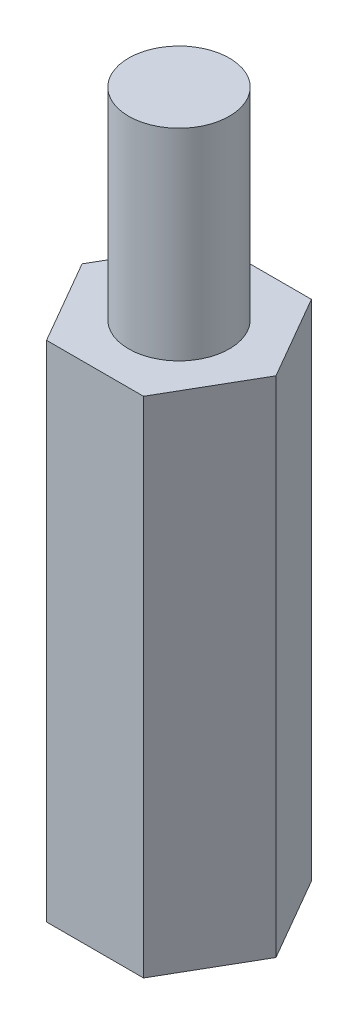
from build123d import *

# Parameters (mm, degrees)
SKETCH_1_R      = 1.5
EXTRUDE_1_DEPTH = 15
SKETCH_2_R      = 1.5
EXTRUDE_2_DEPTH = 6


with BuildPart() as part:
    # Sketch 1 → Extrude 1 (new body)
    with BuildSketch(Plane(origin=(0, 0, 0), x_dir=(1, 0, 0), z_dir=(0, 1, 0))):
        Polygon((2.886751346, 0), (1.443375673, 2.5), (-1.443375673, 2.5), (-2.886751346, 0), (-1.443375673, -2.5), (1.443375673, -2.5), align=None)
        with Locations(Location((0, 0, 0), (0, 0, 270))):
            Circle(SKETCH_1_R, mode=Mode.SUBTRACT)
    extrude(amount=EXTRUDE_1_DEPTH)


with BuildPart() as body_2:
    # Sketch 2 → Extrude 2 (new body)
    with BuildSketch(Plane(origin=(0, 15, 0), x_dir=(1, 0, 0), z_dir=(0, 1, 0))):
        with Locations(Location((0, 0, 0), (0, 0, 270))):
            Circle(SKETCH_2_R)
    extrude(amount=EXTRUDE_2_DEPTH)


solid = Compound([part.part, body_2.part])
